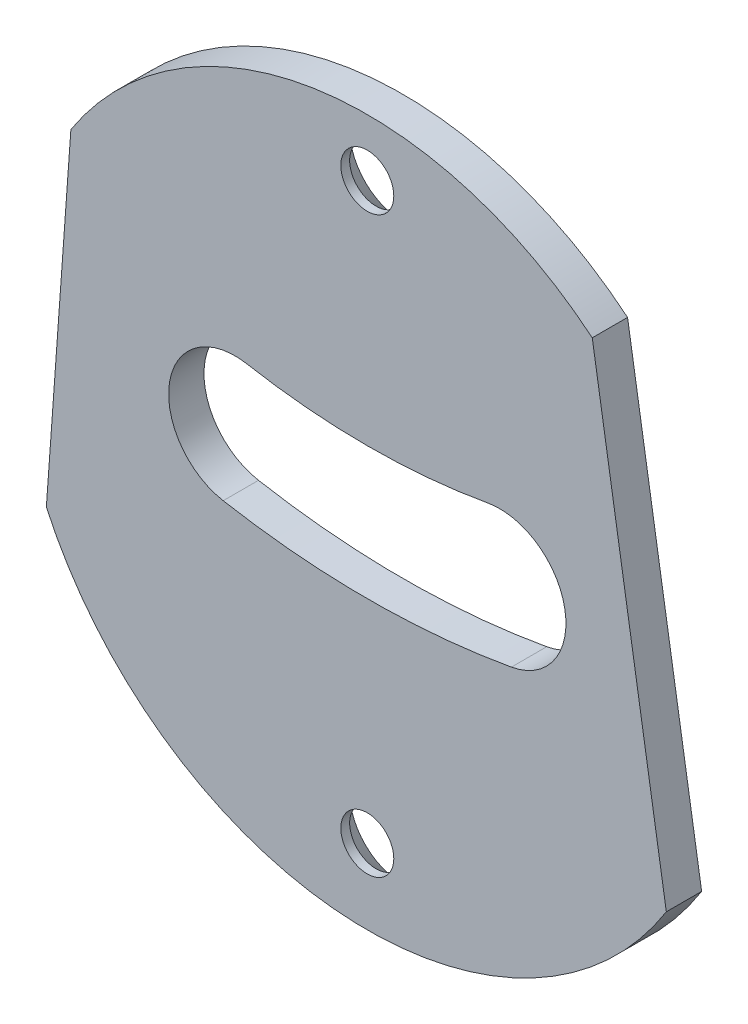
from build123d import *

# Parameters (mm, degrees)
ESQUISSE1_R      = 3
EXTRUSION1_DEPTH = 4
CHANFREIN2_SIZE  = 3


with BuildPart() as part:
    # Esquisse1 → Extrusion1 (new body)
    with BuildSketch(Plane.XY):
        with BuildLine():
            Line((-32.575111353, 1.741938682), (-35.354274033, -36.684326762))
            ThreePointArc((-35.354274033, -36.684326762), (-1.610362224, -59.914734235), (34.871661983, -41.276994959))
            Line((34.871661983, -41.276994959), (26.480535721, 10.834109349))
            ThreePointArc((26.480535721, 10.834109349), (-5.086660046, 19.534194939), (-32.575111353, 1.741938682))
        make_face()
        with Locations((1, 13.5)):
            Circle(ESQUISSE1_R, mode=Mode.SUBTRACT)
        with Locations((1, -51.5)):
            Circle(ESQUISSE1_R, mode=Mode.SUBTRACT)
        with BuildLine():
            ThreePointArc((-12.676470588, -11.283708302), (1, -12.5), (14.676470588, -11.283708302))
            ThreePointArc((14.676470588, -11.283708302), (23.382294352, -17.342473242), (17.323529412, -26.048297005))
            ThreePointArc((17.323529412, -26.048297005), (1, -27.5), (-15.323529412, -26.048297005))
            ThreePointArc((-15.323529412, -26.048297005), (-21.382294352, -17.342473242), (-12.676470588, -11.283708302))
        make_face(mode=Mode.SUBTRACT)
    extrude(amount=EXTRUSION1_DEPTH)

    # Chanfrein2
    chanfrein2_edges = [part.edges().sort_by_distance(p)[0] for p in [
        (-2, 13.5, 0),
        (-2, -51.5, 0),
    ]]
    chamfer(chanfrein2_edges, length=CHANFREIN2_SIZE)


solid = part.part
